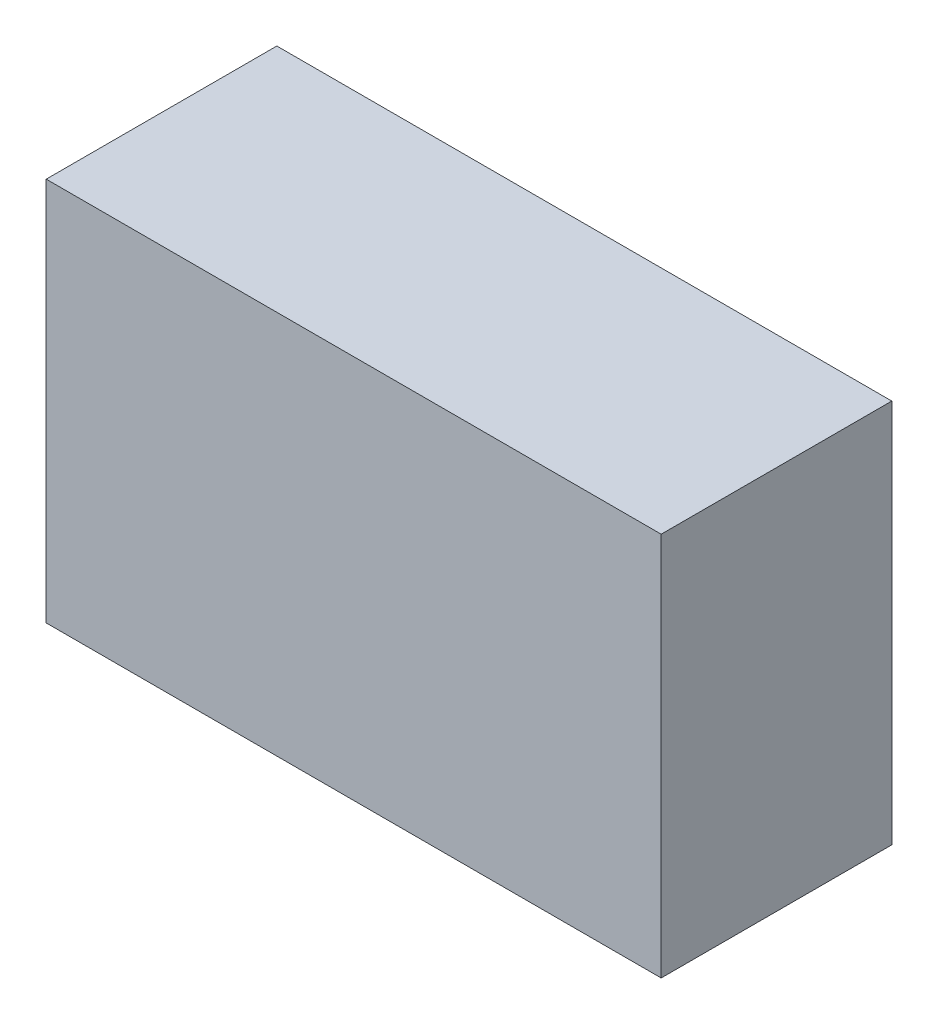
from build123d import *

# Parameters (mm, degrees)
SZKIC1_W                    = 80
SZKIC1_H                    = 50
DODANIE_WYCI_GNI_CIE1_DEPTH = 30


with BuildPart() as part:
    # Szkic1 → Dodanie-wyci_gni_cie1 (new body)
    with BuildSketch(Plane.XY):
        with Locations((40, 25)):
            Rectangle(SZKIC1_W, SZKIC1_H)
    extrude(amount=DODANIE_WYCI_GNI_CIE1_DEPTH)


solid = part.part
